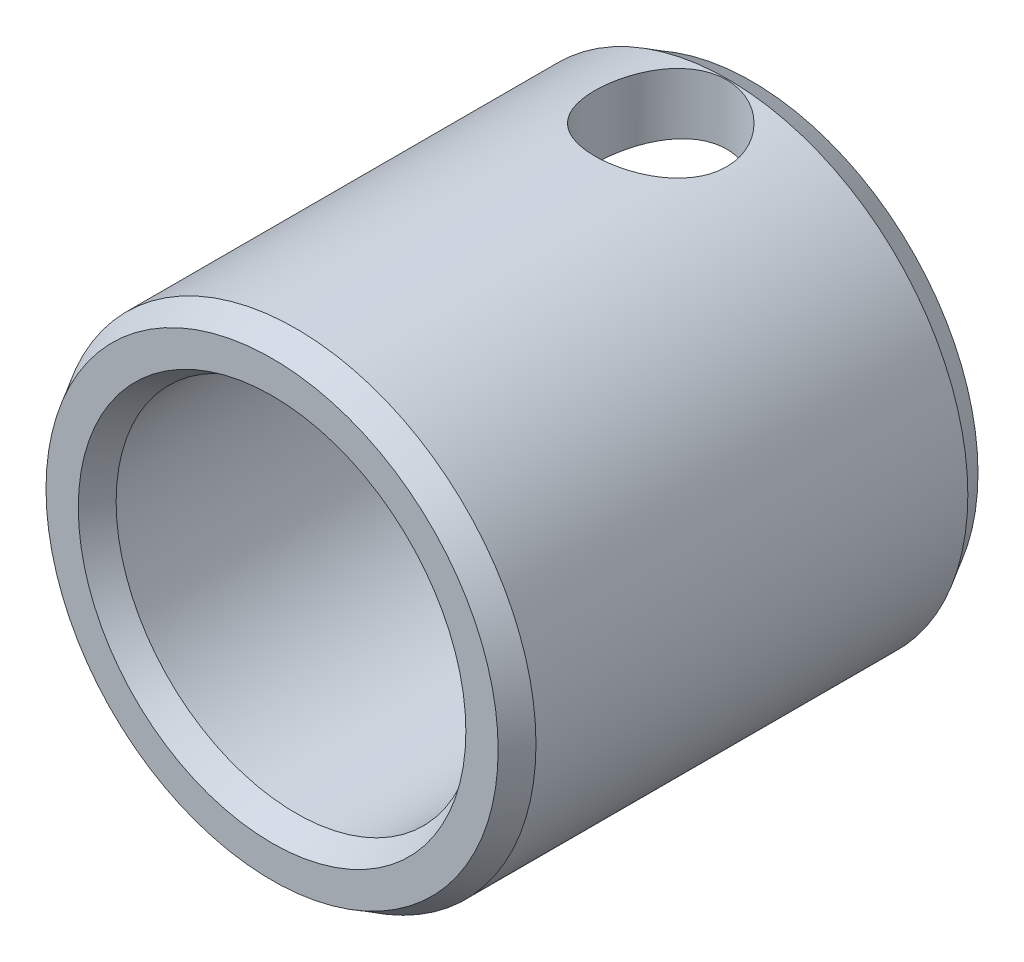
ISO-10303-21;
HEADER;
FILE_DESCRIPTION(('STEP AP214'),'2;1');
FILE_NAME('part.step','',(''),(''),'','','');
FILE_SCHEMA(('AUTOMOTIVE_DESIGN { 1 0 10303 214 1 1 1 1 }'));
ENDSEC;
DATA;
#1=APPLICATION_CONTEXT('core data for automotive mechanical design processes');
#2=APPLICATION_PROTOCOL_DEFINITION('international standard','automotive_design',2000,#1);
#3=PRODUCT_CONTEXT('',#1,'mechanical');
#4=PRODUCT('Part','Part','',(#3));
#5=PRODUCT_RELATED_PRODUCT_CATEGORY('part','',(#4));
#6=PRODUCT_DEFINITION_FORMATION('','',#4);
#7=PRODUCT_DEFINITION_CONTEXT('part definition',#1,'design');
#8=PRODUCT_DEFINITION('design','',#6,#7);
#9=PRODUCT_DEFINITION_SHAPE('','',#8);
#10=(LENGTH_UNIT() NAMED_UNIT(*) SI_UNIT(.MILLI.,.METRE.));
#11=(NAMED_UNIT(*) PLANE_ANGLE_UNIT() SI_UNIT($,.RADIAN.));
#12=(NAMED_UNIT(*) SI_UNIT($,.STERADIAN.) SOLID_ANGLE_UNIT());
#13=UNCERTAINTY_MEASURE_WITH_UNIT(LENGTH_MEASURE(1.E-05),#10,'distance_accuracy_value','');
#14=(GEOMETRIC_REPRESENTATION_CONTEXT(3) GLOBAL_UNCERTAINTY_ASSIGNED_CONTEXT((#13)) GLOBAL_UNIT_ASSIGNED_CONTEXT((#10,
#11,#12)) REPRESENTATION_CONTEXT('',''));
#15=CARTESIAN_POINT('',(0.,0.,0.));
#16=DIRECTION('',(0.,0.,1.));
#17=DIRECTION('',(1.,0.,0.));
#18=AXIS2_PLACEMENT_3D('',#15,#16,#17);
#19=CARTESIAN_POINT('',(0.,0.,25.9335920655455));
#20=DIRECTION('',(0.,0.,1.));
#21=DIRECTION('',(1.,0.,0.));
#22=AXIS2_PLACEMENT_3D('',#19,#20,#21);
#23=CYLINDRICAL_SURFACE('',#22,7.5);
#24=CARTESIAN_POINT('',(0.,0.,19.));
#25=DIRECTION('',(0.,0.,1.));
#26=DIRECTION('',(1.,0.,0.));
#27=AXIS2_PLACEMENT_3D('',#24,#25,#26);
#28=CIRCLE('',#27,7.5);
#29=CARTESIAN_POINT('',(7.5,0.,19.));
#30=VERTEX_POINT('',#29);
#31=EDGE_CURVE('E29',#30,#30,#28,.T.);
#32=ORIENTED_EDGE('',*,*,#31,.T.);
#33=EDGE_LOOP('',(#32));
#34=FACE_BOUND('',#33,.T.);
#35=CARTESIAN_POINT('',(0.,0.,1.));
#36=DIRECTION('',(0.,0.,1.));
#37=DIRECTION('',(1.,0.,0.));
#38=AXIS2_PLACEMENT_3D('',#35,#36,#37);
#39=CIRCLE('',#38,7.5);
#40=CARTESIAN_POINT('',(7.5,0.,1.));
#41=VERTEX_POINT('',#40);
#42=EDGE_CURVE('E34',#41,#41,#39,.T.);
#43=ORIENTED_EDGE('',*,*,#42,.F.);
#44=EDGE_LOOP('',(#43));
#45=FACE_BOUND('',#44,.T.);
#46=CARTESIAN_POINT('',(0.,7.5,6.55));
#47=CARTESIAN_POINT('',(0.149163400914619,7.50000312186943,6.55000423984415));
#48=CARTESIAN_POINT('',(0.29829715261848,7.49551083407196,6.53782548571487));
#49=CARTESIAN_POINT('',(0.592120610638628,7.47803771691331,6.48961923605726));
#50=CARTESIAN_POINT('',(0.736810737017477,7.46505769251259,6.45359400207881));
#51=CARTESIAN_POINT('',(1.01746784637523,7.43200599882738,6.35913145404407));
#52=CARTESIAN_POINT('',(1.15345064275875,7.41194764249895,6.3007361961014));
#53=CARTESIAN_POINT('',(1.41368339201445,7.36674725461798,6.16340019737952));
#54=CARTESIAN_POINT('',(1.53793033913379,7.34160392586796,6.08445421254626));
#55=CARTESIAN_POINT('',(1.7762429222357,7.28769120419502,5.90488341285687));
#56=CARTESIAN_POINT('',(1.88976472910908,7.25882233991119,5.80356699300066));
#57=CARTESIAN_POINT('',(2.09863947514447,7.20121334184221,5.58359974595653));
#58=CARTESIAN_POINT('',(2.19398720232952,7.17247324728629,5.46494396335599));
#59=CARTESIAN_POINT('',(2.36719005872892,7.11723192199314,5.20844037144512));
#60=CARTESIAN_POINT('',(2.44428985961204,7.09084889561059,5.07005454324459));
#61=CARTESIAN_POINT('',(2.5738807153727,7.04484932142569,4.78115937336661));
#62=CARTESIAN_POINT('',(2.626381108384,7.02523020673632,4.63065465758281));
#63=CARTESIAN_POINT('',(2.70315787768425,6.99603990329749,4.3280411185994));
#64=CARTESIAN_POINT('',(2.72846856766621,6.98610194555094,4.17623125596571));
#65=CARTESIAN_POINT('',(2.75338169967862,6.97632326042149,3.87021881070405));
#66=CARTESIAN_POINT('',(2.7529941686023,6.97647859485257,3.71601718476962));
#67=CARTESIAN_POINT('',(2.72731524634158,6.98655161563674,3.41892107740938));
#68=CARTESIAN_POINT('',(2.70343999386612,6.99591416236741,3.2758819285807));
#69=CARTESIAN_POINT('',(2.63379801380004,7.02242705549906,2.9960026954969));
#70=CARTESIAN_POINT('',(2.58802813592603,7.03957852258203,2.85916350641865));
#71=CARTESIAN_POINT('',(2.47508832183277,7.08008337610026,2.59261420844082));
#72=CARTESIAN_POINT('',(2.40754043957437,7.10354498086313,2.46308140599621));
#73=CARTESIAN_POINT('',(2.25322516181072,7.15398860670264,2.21677064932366));
#74=CARTESIAN_POINT('',(2.16645134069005,7.18097180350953,2.09999697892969));
#75=CARTESIAN_POINT('',(1.96960155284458,7.23752687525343,1.87465451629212));
#76=CARTESIAN_POINT('',(1.85838932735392,7.26715387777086,1.767089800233));
#77=CARTESIAN_POINT('',(1.61915779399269,7.32416772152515,1.57184624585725));
#78=CARTESIAN_POINT('',(1.49113612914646,7.3515542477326,1.48417020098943));
#79=CARTESIAN_POINT('',(1.21944943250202,7.40150404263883,1.33015007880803));
#80=CARTESIAN_POINT('',(1.07558804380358,7.42399328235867,1.26412666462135));
#81=CARTESIAN_POINT('',(0.777771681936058,7.46106828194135,1.15754756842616));
#82=CARTESIAN_POINT('',(0.623821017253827,7.47565739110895,1.11698109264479));
#83=CARTESIAN_POINT('',(0.318657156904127,7.49470661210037,1.06436589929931));
#84=CARTESIAN_POINT('',(0.167706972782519,7.49964681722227,1.05096416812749));
#85=CARTESIAN_POINT('',(-0.134347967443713,7.50031608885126,1.04913699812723));
#86=CARTESIAN_POINT('',(-0.285452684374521,7.49604709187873,1.06070630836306));
#87=CARTESIAN_POINT('',(-0.577771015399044,7.47909471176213,1.10745479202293));
#88=CARTESIAN_POINT('',(-0.719144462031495,7.46672323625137,1.14175932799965));
#89=CARTESIAN_POINT('',(-0.994039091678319,7.43512235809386,1.2318650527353));
#90=CARTESIAN_POINT('',(-1.12755925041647,7.41589206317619,1.28766903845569));
#91=CARTESIAN_POINT('',(-1.38727106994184,7.3717934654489,1.42094608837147));
#92=CARTESIAN_POINT('',(-1.51313995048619,7.34677844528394,1.49899813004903));
#93=CARTESIAN_POINT('',(-1.75040675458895,7.29389308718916,1.67389639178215));
#94=CARTESIAN_POINT('',(-1.86179948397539,7.26602173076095,1.77074932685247));
#95=CARTESIAN_POINT('',(-2.073402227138,7.20858443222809,1.98682262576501));
#96=CARTESIAN_POINT('',(-2.17265048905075,7.17901017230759,2.10698505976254));
#97=CARTESIAN_POINT('',(-2.34974917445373,7.12301420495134,2.36285499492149));
#98=CARTESIAN_POINT('',(-2.42759811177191,7.09659271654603,2.49856357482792));
#99=CARTESIAN_POINT('',(-2.55965637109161,7.05004267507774,2.78253737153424));
#100=CARTESIAN_POINT('',(-2.61380312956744,7.02993081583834,2.93083460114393));
#101=CARTESIAN_POINT('',(-2.69602324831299,6.99881623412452,3.23537884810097));
#102=CARTESIAN_POINT('',(-2.72411178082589,6.9878082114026,3.39162118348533));
#103=CARTESIAN_POINT('',(-2.75209516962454,6.97683139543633,3.6972513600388));
#104=CARTESIAN_POINT('',(-2.75362072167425,6.97622414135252,3.84646829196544));
#105=CARTESIAN_POINT('',(-2.73257863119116,6.98449276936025,4.14291155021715));
#106=CARTESIAN_POINT('',(-2.710013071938,6.99336783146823,4.29013804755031));
#107=CARTESIAN_POINT('',(-2.64267697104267,7.01908063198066,4.57426908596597));
#108=CARTESIAN_POINT('',(-2.59854310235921,7.03568945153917,4.7113469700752));
#109=CARTESIAN_POINT('',(-2.48987356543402,7.0748745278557,4.9762391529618));
#110=CARTESIAN_POINT('',(-2.42533285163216,7.09745226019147,5.10405115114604));
#111=CARTESIAN_POINT('',(-2.2738785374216,7.14745651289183,5.353826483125));
#112=CARTESIAN_POINT('',(-2.18599626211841,7.17507087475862,5.47516442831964));
#113=CARTESIAN_POINT('',(-1.99188099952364,7.23136315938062,5.70189324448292));
#114=CARTESIAN_POINT('',(-1.88564231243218,7.26004141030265,5.8072791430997));
#115=CARTESIAN_POINT('',(-1.65137159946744,7.31698041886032,6.00455997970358));
#116=CARTESIAN_POINT('',(-1.52250654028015,7.34514593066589,6.09549740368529));
#117=CARTESIAN_POINT('',(-1.25034215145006,7.39633669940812,6.25437734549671));
#118=CARTESIAN_POINT('',(-1.10704276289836,7.41936193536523,6.32231976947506));
#119=CARTESIAN_POINT('',(-0.806234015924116,7.45811714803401,6.43416997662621));
#120=CARTESIAN_POINT('',(-0.648460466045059,7.4736521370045,6.4774402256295));
#121=CARTESIAN_POINT('',(-0.32711098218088,7.49458959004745,6.53534652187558));
#122=CARTESIAN_POINT('',(-0.163537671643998,7.4999965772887,6.5499953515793));
#123=CARTESIAN_POINT('',(0.,7.5,6.55));
#124=B_SPLINE_CURVE_WITH_KNOTS('',3,(#46,#47,#48,#49,#50,#51,#52,#53,#54,#55,#56,#57,#58,#59,
#60,#61,#62,#63,#64,#65,#66,#67,#68,#69,#70,#71,#72,#73,#74,#75,#76,#77,#78,#79,#80,#81,#82,#83,
#84,#85,#86,#87,#88,#89,#90,#91,#92,#93,#94,#95,#96,#97,#98,#99,#100,#101,#102,#103,#104,#105,
#106,#107,#108,#109,#110,#111,#112,#113,#114,#115,#116,#117,#118,#119,#120,#121,#122,#123),
.UNSPECIFIED.,.T.,.F.,(4,2,2,2,2,2,2,2,2,2,2,2,2,2,2,2,2,2,2,2,2,2,2,2,2,2,2,2,2,2,2,2,2,2,2,2,
2,2,4),(0.,0.446887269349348,0.893732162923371,1.33974106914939,1.7858638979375,
2.24842473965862,2.71111803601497,3.19050672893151,3.6697132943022,4.12996375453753,
4.59003463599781,5.02396705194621,5.45796192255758,5.89993527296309,6.34205656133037,
6.81248619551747,7.28298186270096,7.7601599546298,8.2371355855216,8.68970480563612,
9.14217886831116,9.57818454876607,10.0142469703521,10.462896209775,10.9117059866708,
11.385386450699,11.8590998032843,12.3340561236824,12.80873572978,13.254164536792,
13.6995548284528,14.13252653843,14.5656053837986,15.020648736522,15.4758336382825,
15.9541458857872,16.4324600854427,16.9226310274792,17.4125830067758),.UNSPECIFIED.);
#125=CARTESIAN_POINT('',(0.,7.5,6.55));
#126=VERTEX_POINT('',#125);
#127=EDGE_CURVE('E49',#126,#126,#124,.T.);
#128=ORIENTED_EDGE('',*,*,#127,.T.);
#129=EDGE_LOOP('',(#128));
#130=FACE_BOUND('',#129,.T.);
#131=ADVANCED_FACE('F12',(#34,#45,#130),#23,.F.);
#132=CARTESIAN_POINT('',(0.,0.,25.9335920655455));
#133=DIRECTION('',(0.,0.,1.));
#134=DIRECTION('',(1.,0.,0.));
#135=AXIS2_PLACEMENT_3D('',#132,#133,#134);
#136=CYLINDRICAL_SURFACE('',#135,10.);
#137=CARTESIAN_POINT('',(0.,0.,19.));
#138=DIRECTION('',(0.,0.,1.));
#139=DIRECTION('',(1.,0.,0.));
#140=AXIS2_PLACEMENT_3D('',#137,#138,#139);
#141=CIRCLE('',#140,10.);
#142=CARTESIAN_POINT('',(10.,0.,19.));
#143=VERTEX_POINT('',#142);
#144=EDGE_CURVE('E46',#143,#143,#141,.T.);
#145=ORIENTED_EDGE('',*,*,#144,.F.);
#146=EDGE_LOOP('',(#145));
#147=FACE_BOUND('',#146,.T.);
#148=CARTESIAN_POINT('',(0.,0.,1.));
#149=DIRECTION('',(0.,0.,1.));
#150=DIRECTION('',(1.,0.,0.));
#151=AXIS2_PLACEMENT_3D('',#148,#149,#150);
#152=CIRCLE('',#151,10.);
#153=CARTESIAN_POINT('',(10.,0.,1.));
#154=VERTEX_POINT('',#153);
#155=EDGE_CURVE('E43',#154,#154,#152,.T.);
#156=ORIENTED_EDGE('',*,*,#155,.T.);
#157=EDGE_LOOP('',(#156));
#158=FACE_BOUND('',#157,.T.);
#159=CARTESIAN_POINT('',(0.,10.,6.55));
#160=CARTESIAN_POINT('',(-0.15142288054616,9.99999790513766,6.54999678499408));
#161=CARTESIAN_POINT('',(-0.302879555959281,9.99652704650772,6.53745149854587));
#162=CARTESIAN_POINT('',(-0.60141835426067,9.9830186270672,6.48769783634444));
#163=CARTESIAN_POINT('',(-0.748498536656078,9.97297819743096,6.45047868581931));
#164=CARTESIAN_POINT('',(-1.03393279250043,9.94743692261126,6.35268752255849));
#165=CARTESIAN_POINT('',(-1.17229822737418,9.93194336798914,6.29214667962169));
#166=CARTESIAN_POINT('',(-1.43691255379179,9.89712668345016,6.14954921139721));
#167=CARTESIAN_POINT('',(-1.56316043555,9.87780323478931,6.06749079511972));
#168=CARTESIAN_POINT('',(-1.80305227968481,9.83687707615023,5.882063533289));
#169=CARTESIAN_POINT('',(-1.91635675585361,9.81523348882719,5.77826450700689));
#170=CARTESIAN_POINT('',(-2.12418937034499,9.77236429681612,5.55322139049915));
#171=CARTESIAN_POINT('',(-2.21871492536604,9.75113874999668,5.43197490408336));
#172=CARTESIAN_POINT('',(-2.3879928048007,9.71108741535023,5.1727300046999));
#173=CARTESIAN_POINT('',(-2.46234890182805,9.69231302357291,5.03446419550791));
#174=CARTESIAN_POINT('',(-2.58662289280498,9.65989315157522,4.7467931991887));
#175=CARTESIAN_POINT('',(-2.63654561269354,9.64624665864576,4.597390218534));
#176=CARTESIAN_POINT('',(-2.70934583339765,9.62605068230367,4.29545889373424));
#177=CARTESIAN_POINT('',(-2.73284141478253,9.61933931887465,4.14309067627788));
#178=CARTESIAN_POINT('',(-2.75404817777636,9.61329031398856,3.83643877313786));
#179=CARTESIAN_POINT('',(-2.7517645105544,9.61395119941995,3.68215547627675));
#180=CARTESIAN_POINT('',(-2.72196703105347,9.62242747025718,3.38092425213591));
#181=CARTESIAN_POINT('',(-2.69520726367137,9.63002901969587,3.23389475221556));
#182=CARTESIAN_POINT('',(-2.61842742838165,9.6511868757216,2.9464974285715));
#183=CARTESIAN_POINT('',(-2.56840539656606,9.66474368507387,2.80613016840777));
#184=CARTESIAN_POINT('',(-2.4459209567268,9.6964683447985,2.53410558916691));
#185=CARTESIAN_POINT('',(-2.37319900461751,9.71468906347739,2.40257156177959));
#186=CARTESIAN_POINT('',(-2.20755990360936,9.75366083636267,2.15331151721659));
#187=CARTESIAN_POINT('',(-2.11463855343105,9.77441241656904,2.03558838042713));
#188=CARTESIAN_POINT('',(-1.90740929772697,9.81699239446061,1.81299085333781));
#189=CARTESIAN_POINT('',(-1.79246989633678,9.83883313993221,1.70870584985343));
#190=CARTESIAN_POINT('',(-1.54646529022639,9.88048509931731,1.5207665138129));
#191=CARTESIAN_POINT('',(-1.41539936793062,9.90029622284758,1.43711309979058));
#192=CARTESIAN_POINT('',(-1.13991171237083,9.93579173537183,1.29252903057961));
#193=CARTESIAN_POINT('',(-0.995428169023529,9.95145560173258,1.23171077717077));
#194=CARTESIAN_POINT('',(-0.697756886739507,9.97674362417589,1.13540050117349));
#195=CARTESIAN_POINT('',(-0.544571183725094,9.98636918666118,1.09990258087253));
#196=CARTESIAN_POINT('',(-0.238869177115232,9.99828101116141,1.05617934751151));
#197=CARTESIAN_POINT('',(-0.0864756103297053,10.0007826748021,1.04715335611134));
#198=CARTESIAN_POINT('',(0.217649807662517,9.9987871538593,1.05441110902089));
#199=CARTESIAN_POINT('',(0.369381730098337,9.99429074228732,1.07069205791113));
#200=CARTESIAN_POINT('',(0.664979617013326,9.97894393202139,1.12744676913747));
#201=CARTESIAN_POINT('',(0.808939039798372,9.9682122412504,1.16746883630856));
#202=CARTESIAN_POINT('',(1.0880827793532,9.94161719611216,1.27004065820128));
#203=CARTESIAN_POINT('',(1.22326611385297,9.92575326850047,1.33259292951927));
#204=CARTESIAN_POINT('',(1.48409215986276,9.89015496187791,1.47990036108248));
#205=CARTESIAN_POINT('',(1.60948250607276,9.8703479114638,1.56508435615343));
#206=CARTESIAN_POINT('',(1.84446827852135,9.82915015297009,1.75470256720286));
#207=CARTESIAN_POINT('',(1.95406037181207,9.80775911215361,1.85914083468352));
#208=CARTESIAN_POINT('',(2.15775026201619,9.7650031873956,2.08804742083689));
#209=CARTESIAN_POINT('',(2.25128173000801,9.74365851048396,2.21302443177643));
#210=CARTESIAN_POINT('',(2.41606367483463,9.70411480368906,2.47735585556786));
#211=CARTESIAN_POINT('',(2.48731502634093,9.68591565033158,2.61670970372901));
#212=CARTESIAN_POINT('',(2.60498194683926,9.65493519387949,2.9051872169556));
#213=CARTESIAN_POINT('',(2.65153712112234,9.64212352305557,3.05425049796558));
#214=CARTESIAN_POINT('',(2.71879365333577,9.62337795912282,3.35850589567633));
#215=CARTESIAN_POINT('',(2.73950213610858,9.61744217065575,3.51369631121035));
#216=CARTESIAN_POINT('',(2.75404886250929,9.6132857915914,3.81998313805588));
#217=CARTESIAN_POINT('',(2.7488002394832,9.614803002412,3.97103325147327));
#218=CARTESIAN_POINT('',(2.71371466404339,9.62476380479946,4.27000569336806));
#219=CARTESIAN_POINT('',(2.68387842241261,9.63320719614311,4.41792811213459));
#220=CARTESIAN_POINT('',(2.60100915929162,9.65590796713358,4.70521496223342));
#221=CARTESIAN_POINT('',(2.54818121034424,9.67011387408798,4.84464290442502));
#222=CARTESIAN_POINT('',(2.4209868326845,9.70273746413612,5.11276434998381));
#223=CARTESIAN_POINT('',(2.34661683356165,9.72115584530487,5.24145606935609));
#224=CARTESIAN_POINT('',(2.17573113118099,9.76084545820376,5.48878195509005));
#225=CARTESIAN_POINT('',(2.07859788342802,9.78218767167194,5.60697809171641));
#226=CARTESIAN_POINT('',(1.86610223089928,9.82493707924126,5.82568951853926));
#227=CARTESIAN_POINT('',(1.75073533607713,9.84634428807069,5.92620044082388));
#228=CARTESIAN_POINT('',(1.50182041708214,9.88740569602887,6.10898765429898));
#229=CARTESIAN_POINT('',(1.36791284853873,9.907007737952,6.19078709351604));
#230=CARTESIAN_POINT('',(1.08770978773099,9.94166772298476,6.33058644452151));
#231=CARTESIAN_POINT('',(0.941421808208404,9.95672839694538,6.38860066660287));
#232=CARTESIAN_POINT('',(0.663199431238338,9.97880995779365,6.4721727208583));
#233=CARTESIAN_POINT('',(0.532391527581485,9.9866965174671,6.50128757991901));
#234=CARTESIAN_POINT('',(0.2677309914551,9.9972921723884,6.54020155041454));
#235=CARTESIAN_POINT('',(0.13387870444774,10.0000018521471,6.55000284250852));
#236=CARTESIAN_POINT('',(0.,10.,6.55));
#237=B_SPLINE_CURVE_WITH_KNOTS('',3,(#159,#160,#161,#162,#163,#164,#165,#166,#167,#168,#169,
#170,#171,#172,#173,#174,#175,#176,#177,#178,#179,#180,#181,#182,#183,#184,#185,#186,#187,#188,
#189,#190,#191,#192,#193,#194,#195,#196,#197,#198,#199,#200,#201,#202,#203,#204,#205,#206,#207,
#208,#209,#210,#211,#212,#213,#214,#215,#216,#217,#218,#219,#220,#221,#222,#223,#224,#225,#226,
#227,#228,#229,#230,#231,#232,#233,#234,#235,#236),.UNSPECIFIED.,.T.,.F.,(4,2,2,2,2,2,2,2,2,2,2,
2,2,2,2,2,2,2,2,2,2,2,2,2,2,2,2,2,2,2,2,2,2,2,2,2,2,2,4),(0.,0.45377748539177,0.907753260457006,
1.36112438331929,1.81453325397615,2.27794447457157,2.74141939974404,3.21343018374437,
3.68534770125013,4.14598225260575,4.60652476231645,5.0533402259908,5.50019341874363,
5.95235548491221,6.40461168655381,6.87259959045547,7.34060832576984,7.81089145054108,
8.28106499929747,8.73686293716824,9.19261053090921,9.63995333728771,10.0873461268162,
10.5439096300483,11.0005693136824,11.4709880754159,11.9413883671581,12.4091004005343,
12.8766834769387,13.3279371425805,13.7791777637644,14.2264735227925,14.6738434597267,
15.1351456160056,15.5965615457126,16.0686764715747,16.5405069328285,16.9417541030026,
17.3429559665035),.UNSPECIFIED.);
#238=CARTESIAN_POINT('',(0.,10.,6.55));
#239=VERTEX_POINT('',#238);
#240=EDGE_CURVE('E16',#239,#239,#237,.T.);
#241=ORIENTED_EDGE('',*,*,#240,.T.);
#242=EDGE_LOOP('',(#241));
#243=FACE_BOUND('',#242,.T.);
#244=ADVANCED_FACE('F63',(#147,#158,#243),#136,.T.);
#245=CARTESIAN_POINT('',(0.,0.,19.));
#246=DIRECTION('',(0.,0.,-1.));
#247=DIRECTION('',(-1.,0.,0.));
#248=AXIS2_PLACEMENT_3D('',#245,#246,#247);
#249=CONICAL_SURFACE('',#248,10.,0.52359877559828);
#250=CARTESIAN_POINT('',(0.,0.,20.));
#251=DIRECTION('',(0.,0.,1.));
#252=DIRECTION('',(1.,0.,0.));
#253=AXIS2_PLACEMENT_3D('',#250,#251,#252);
#254=CIRCLE('',#253,9.42264973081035);
#255=CARTESIAN_POINT('',(9.42264973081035,0.,20.));
#256=VERTEX_POINT('',#255);
#257=EDGE_CURVE('E8',#256,#256,#254,.T.);
#258=ORIENTED_EDGE('',*,*,#257,.F.);
#259=EDGE_LOOP('',(#258));
#260=FACE_BOUND('',#259,.T.);
#261=ORIENTED_EDGE('',*,*,#144,.T.);
#262=EDGE_LOOP('',(#261));
#263=FACE_BOUND('',#262,.T.);
#264=ADVANCED_FACE('F14',(#260,#263),#249,.T.);
#265=CARTESIAN_POINT('',(0.,-8.07735026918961,20.));
#266=DIRECTION('',(0.,0.,1.));
#267=DIRECTION('',(1.,0.,0.));
#268=AXIS2_PLACEMENT_3D('',#265,#266,#267);
#269=PLANE('',#268);
#270=ORIENTED_EDGE('',*,*,#257,.T.);
#271=EDGE_LOOP('',(#270));
#272=FACE_BOUND('',#271,.T.);
#273=CARTESIAN_POINT('',(0.,0.,20.));
#274=DIRECTION('',(0.,0.,1.));
#275=DIRECTION('',(1.,0.,0.));
#276=AXIS2_PLACEMENT_3D('',#273,#274,#275);
#277=CIRCLE('',#276,8.07735026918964);
#278=CARTESIAN_POINT('',(8.07735026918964,0.,20.));
#279=VERTEX_POINT('',#278);
#280=EDGE_CURVE('E25',#279,#279,#277,.T.);
#281=ORIENTED_EDGE('',*,*,#280,.F.);
#282=EDGE_LOOP('',(#281));
#283=FACE_BOUND('',#282,.T.);
#284=ADVANCED_FACE('F84',(#272,#283),#269,.T.);
#285=CARTESIAN_POINT('',(0.,0.,19.));
#286=DIRECTION('',(0.,0.,1.));
#287=DIRECTION('',(1.,0.,0.));
#288=AXIS2_PLACEMENT_3D('',#285,#286,#287);
#289=CONICAL_SURFACE('',#288,7.5,0.52359877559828);
#290=ORIENTED_EDGE('',*,*,#280,.T.);
#291=EDGE_LOOP('',(#290));
#292=FACE_BOUND('',#291,.T.);
#293=ORIENTED_EDGE('',*,*,#31,.F.);
#294=EDGE_LOOP('',(#293));
#295=FACE_BOUND('',#294,.T.);
#296=ADVANCED_FACE('F77',(#292,#295),#289,.F.);
#297=CARTESIAN_POINT('',(0.,0.,1.));
#298=DIRECTION('',(0.,0.,-1.));
#299=DIRECTION('',(-1.,0.,0.));
#300=AXIS2_PLACEMENT_3D('',#297,#298,#299);
#301=CONICAL_SURFACE('',#300,7.5,0.523598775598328);
#302=CARTESIAN_POINT('',(0.,0.,0.));
#303=DIRECTION('',(0.,0.,1.));
#304=DIRECTION('',(1.,0.,0.));
#305=AXIS2_PLACEMENT_3D('',#302,#303,#304);
#306=CIRCLE('',#305,8.07735026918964);
#307=CARTESIAN_POINT('',(8.07735026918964,0.,0.));
#308=VERTEX_POINT('',#307);
#309=EDGE_CURVE('E37',#308,#308,#306,.T.);
#310=ORIENTED_EDGE('',*,*,#309,.F.);
#311=EDGE_LOOP('',(#310));
#312=FACE_BOUND('',#311,.T.);
#313=ORIENTED_EDGE('',*,*,#42,.T.);
#314=EDGE_LOOP('',(#313));
#315=FACE_BOUND('',#314,.T.);
#316=ADVANCED_FACE('F74',(#312,#315),#301,.F.);
#317=CARTESIAN_POINT('',(0.,-9.4226497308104,0.));
#318=DIRECTION('',(0.,0.,-1.));
#319=DIRECTION('',(-1.,0.,0.));
#320=AXIS2_PLACEMENT_3D('',#317,#318,#319);
#321=PLANE('',#320);
#322=ORIENTED_EDGE('',*,*,#309,.T.);
#323=EDGE_LOOP('',(#322));
#324=FACE_BOUND('',#323,.T.);
#325=CARTESIAN_POINT('',(0.,0.,0.));
#326=DIRECTION('',(0.,0.,1.));
#327=DIRECTION('',(1.,0.,0.));
#328=AXIS2_PLACEMENT_3D('',#325,#326,#327);
#329=CIRCLE('',#328,9.42264973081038);
#330=CARTESIAN_POINT('',(9.42264973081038,0.,0.));
#331=VERTEX_POINT('',#330);
#332=EDGE_CURVE('E40',#331,#331,#329,.T.);
#333=ORIENTED_EDGE('',*,*,#332,.F.);
#334=EDGE_LOOP('',(#333));
#335=FACE_BOUND('',#334,.T.);
#336=ADVANCED_FACE('F71',(#324,#335),#321,.T.);
#337=CARTESIAN_POINT('',(0.,0.,1.));
#338=DIRECTION('',(0.,0.,1.));
#339=DIRECTION('',(1.,0.,0.));
#340=AXIS2_PLACEMENT_3D('',#337,#338,#339);
#341=CONICAL_SURFACE('',#340,10.,0.523598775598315);
#342=ORIENTED_EDGE('',*,*,#332,.T.);
#343=EDGE_LOOP('',(#342));
#344=FACE_BOUND('',#343,.T.);
#345=ORIENTED_EDGE('',*,*,#155,.F.);
#346=EDGE_LOOP('',(#345));
#347=FACE_BOUND('',#346,.T.);
#348=ADVANCED_FACE('F61',(#344,#347),#341,.T.);
#349=CARTESIAN_POINT('',(0.,16.,3.8));
#350=DIRECTION('',(0.,-1.,0.));
#351=DIRECTION('',(0.,0.,1.));
#352=AXIS2_PLACEMENT_3D('',#349,#350,#351);
#353=CYLINDRICAL_SURFACE('',#352,2.75);
#354=ORIENTED_EDGE('',*,*,#127,.F.);
#355=EDGE_LOOP('',(#354));
#356=FACE_BOUND('',#355,.T.);
#357=ORIENTED_EDGE('',*,*,#240,.F.);
#358=EDGE_LOOP('',(#357));
#359=FACE_BOUND('',#358,.T.);
#360=ADVANCED_FACE('F58',(#356,#359),#353,.F.);
#361=CLOSED_SHELL('',(#131,#244,#264,#284,#296,#316,#336,#348,#360));
#362=MANIFOLD_SOLID_BREP('B1',#361);
#363=ADVANCED_BREP_SHAPE_REPRESENTATION('',(#18,#362),#14);
#364=SHAPE_DEFINITION_REPRESENTATION(#9,#363);
ENDSEC;
END-ISO-10303-21;
